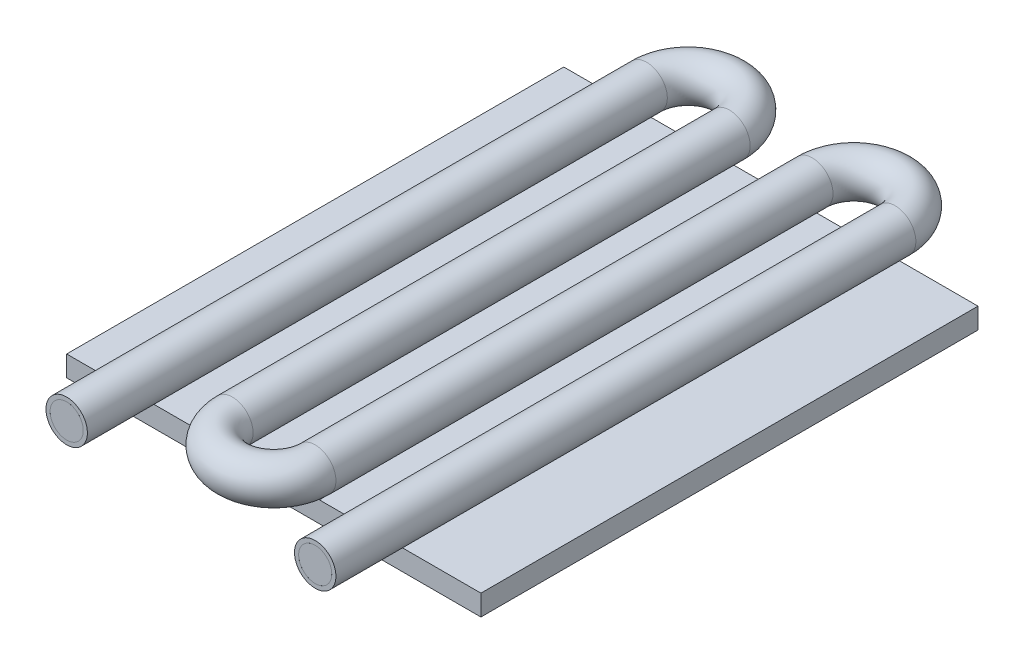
ISO-10303-21;
HEADER;
FILE_DESCRIPTION(('STEP AP214'),'2;1');
FILE_NAME('part.step','',(''),(''),'','','');
FILE_SCHEMA(('AUTOMOTIVE_DESIGN { 1 0 10303 214 1 1 1 1 }'));
ENDSEC;
DATA;
#1=APPLICATION_CONTEXT('core data for automotive mechanical design processes');
#2=APPLICATION_PROTOCOL_DEFINITION('international standard','automotive_design',2000,#1);
#3=PRODUCT_CONTEXT('',#1,'mechanical');
#4=PRODUCT('Part','Part','',(#3));
#5=PRODUCT_RELATED_PRODUCT_CATEGORY('part','',(#4));
#6=PRODUCT_DEFINITION_FORMATION('','',#4);
#7=PRODUCT_DEFINITION_CONTEXT('part definition',#1,'design');
#8=PRODUCT_DEFINITION('design','',#6,#7);
#9=PRODUCT_DEFINITION_SHAPE('','',#8);
#10=(LENGTH_UNIT() NAMED_UNIT(*) SI_UNIT(.MILLI.,.METRE.));
#11=(NAMED_UNIT(*) PLANE_ANGLE_UNIT() SI_UNIT($,.RADIAN.));
#12=(NAMED_UNIT(*) SI_UNIT($,.STERADIAN.) SOLID_ANGLE_UNIT());
#13=UNCERTAINTY_MEASURE_WITH_UNIT(LENGTH_MEASURE(1.E-05),#10,'distance_accuracy_value','');
#14=(GEOMETRIC_REPRESENTATION_CONTEXT(3) GLOBAL_UNCERTAINTY_ASSIGNED_CONTEXT((#13)) GLOBAL_UNIT_ASSIGNED_CONTEXT((#10,
#11,#12)) REPRESENTATION_CONTEXT('',''));
#15=CARTESIAN_POINT('',(0.,0.,0.));
#16=DIRECTION('',(0.,0.,1.));
#17=DIRECTION('',(1.,0.,0.));
#18=AXIS2_PLACEMENT_3D('',#15,#16,#17);
#19=CARTESIAN_POINT('',(60.,22.,155.));
#20=DIRECTION('',(0.,0.,1.));
#21=DIRECTION('',(1.,0.,0.));
#22=AXIS2_PLACEMENT_3D('',#19,#20,#21);
#23=CYLINDRICAL_SURFACE('',#22,8.);
#24=CARTESIAN_POINT('',(60.,22.,155.));
#25=DIRECTION('',(0.,0.,1.));
#26=DIRECTION('',(1.,0.,0.));
#27=AXIS2_PLACEMENT_3D('',#24,#25,#26);
#28=CIRCLE('',#27,8.);
#29=CARTESIAN_POINT('',(68.,22.,155.));
#30=VERTEX_POINT('',#29);
#31=EDGE_CURVE('E12',#30,#30,#28,.T.);
#32=ORIENTED_EDGE('',*,*,#31,.T.);
#33=EDGE_LOOP('',(#32));
#34=FACE_BOUND('',#33,.T.);
#35=CARTESIAN_POINT('',(60.,22.,160.));
#36=DIRECTION('',(0.,0.,1.));
#37=DIRECTION('',(1.,0.,0.));
#38=AXIS2_PLACEMENT_3D('',#35,#36,#37);
#39=CIRCLE('',#38,8.);
#40=CARTESIAN_POINT('',(68.,22.,160.));
#41=VERTEX_POINT('',#40);
#42=EDGE_CURVE('E65',#41,#41,#39,.T.);
#43=ORIENTED_EDGE('',*,*,#42,.F.);
#44=EDGE_LOOP('',(#43));
#45=FACE_BOUND('',#44,.T.);
#46=ADVANCED_FACE('F62',(#34,#45),#23,.T.);
#47=CARTESIAN_POINT('',(60.,22.,155.));
#48=DIRECTION('',(0.,0.,1.));
#49=DIRECTION('',(1.,0.,0.));
#50=AXIS2_PLACEMENT_3D('',#47,#48,#49);
#51=PLANE('',#50);
#52=ORIENTED_EDGE('',*,*,#31,.F.);
#53=EDGE_LOOP('',(#52));
#54=FACE_BOUND('',#53,.T.);
#55=ADVANCED_FACE('F77',(#54),#51,.F.);
#56=CARTESIAN_POINT('',(60.,22.,160.));
#57=DIRECTION('',(0.,0.,1.));
#58=DIRECTION('',(1.,0.,0.));
#59=AXIS2_PLACEMENT_3D('',#56,#57,#58);
#60=PLANE('',#59);
#61=ORIENTED_EDGE('',*,*,#42,.T.);
#62=EDGE_LOOP('',(#61));
#63=FACE_BOUND('',#62,.T.);
#64=ADVANCED_FACE('F74',(#63),#60,.T.);
#65=CLOSED_SHELL('',(#46,#55,#64));
#66=MANIFOLD_SOLID_BREP('B2',#65);
#67=CARTESIAN_POINT('',(-60.,22.,155.));
#68=DIRECTION('',(0.,0.,1.));
#69=DIRECTION('',(1.,0.,0.));
#70=AXIS2_PLACEMENT_3D('',#67,#68,#69);
#71=CYLINDRICAL_SURFACE('',#70,8.);
#72=CARTESIAN_POINT('',(-60.,22.,155.));
#73=DIRECTION('',(0.,0.,1.));
#74=DIRECTION('',(1.,0.,0.));
#75=AXIS2_PLACEMENT_3D('',#72,#73,#74);
#76=CIRCLE('',#75,8.);
#77=CARTESIAN_POINT('',(-52.,22.,155.));
#78=VERTEX_POINT('',#77);
#79=EDGE_CURVE('E61',#78,#78,#76,.T.);
#80=ORIENTED_EDGE('',*,*,#79,.T.);
#81=EDGE_LOOP('',(#80));
#82=FACE_BOUND('',#81,.T.);
#83=CARTESIAN_POINT('',(-60.,22.,160.));
#84=DIRECTION('',(0.,0.,1.));
#85=DIRECTION('',(1.,0.,0.));
#86=AXIS2_PLACEMENT_3D('',#83,#84,#85);
#87=CIRCLE('',#86,8.);
#88=CARTESIAN_POINT('',(-52.,22.,160.));
#89=VERTEX_POINT('',#88);
#90=EDGE_CURVE('E119',#89,#89,#87,.T.);
#91=ORIENTED_EDGE('',*,*,#90,.F.);
#92=EDGE_LOOP('',(#91));
#93=FACE_BOUND('',#92,.T.);
#94=ADVANCED_FACE('F116',(#82,#93),#71,.T.);
#95=CARTESIAN_POINT('',(-60.,22.,155.));
#96=DIRECTION('',(0.,0.,1.));
#97=DIRECTION('',(1.,0.,0.));
#98=AXIS2_PLACEMENT_3D('',#95,#96,#97);
#99=PLANE('',#98);
#100=ORIENTED_EDGE('',*,*,#79,.F.);
#101=EDGE_LOOP('',(#100));
#102=FACE_BOUND('',#101,.T.);
#103=ADVANCED_FACE('F131',(#102),#99,.F.);
#104=CARTESIAN_POINT('',(-60.,22.,160.));
#105=DIRECTION('',(0.,0.,1.));
#106=DIRECTION('',(1.,0.,0.));
#107=AXIS2_PLACEMENT_3D('',#104,#105,#106);
#108=PLANE('',#107);
#109=ORIENTED_EDGE('',*,*,#90,.T.);
#110=EDGE_LOOP('',(#109));
#111=FACE_BOUND('',#110,.T.);
#112=ADVANCED_FACE('F128',(#111),#108,.T.);
#113=CLOSED_SHELL('',(#94,#103,#112));
#114=MANIFOLD_SOLID_BREP('B7',#113);
#115=CARTESIAN_POINT('',(0.,10.,0.));
#116=DIRECTION('',(0.,-1.,0.));
#117=DIRECTION('',(0.,0.,-1.));
#118=AXIS2_PLACEMENT_3D('',#115,#116,#117);
#119=PLANE('',#118);
#120=DIRECTION('',(1.,0.,0.));
#121=VECTOR('',#120,1.);
#122=CARTESIAN_POINT('',(-100.,10.,120.));
#123=LINE('',#122,#121);
#124=CARTESIAN_POINT('',(-18.,10.,120.));
#125=VERTEX_POINT('',#124);
#126=CARTESIAN_POINT('',(18.,10.,120.));
#127=VERTEX_POINT('',#126);
#128=EDGE_CURVE('E184',#125,#127,#123,.T.);
#129=ORIENTED_EDGE('',*,*,#128,.T.);
#130=DIRECTION('',(0.,0.,1.));
#131=VECTOR('',#130,1.);
#132=CARTESIAN_POINT('',(18.,10.,-124.882622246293));
#133=LINE('',#132,#131);
#134=CARTESIAN_POINT('',(18.,10.,-120.));
#135=VERTEX_POINT('',#134);
#136=EDGE_CURVE('E313',#135,#127,#133,.T.);
#137=ORIENTED_EDGE('',*,*,#136,.F.);
#138=DIRECTION('',(-1.,0.,0.));
#139=VECTOR('',#138,1.);
#140=CARTESIAN_POINT('',(-100.,10.,-120.));
#141=LINE('',#140,#139);
#142=CARTESIAN_POINT('',(-18.,10.,-120.));
#143=VERTEX_POINT('',#142);
#144=EDGE_CURVE('E299',#135,#143,#141,.T.);
#145=ORIENTED_EDGE('',*,*,#144,.T.);
#146=DIRECTION('',(0.,0.,1.));
#147=VECTOR('',#146,1.);
#148=CARTESIAN_POINT('',(-18.,10.,-124.882622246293));
#149=LINE('',#148,#147);
#150=EDGE_CURVE('E337',#143,#125,#149,.T.);
#151=ORIENTED_EDGE('',*,*,#150,.T.);
#152=EDGE_LOOP('',(#129,#137,#145,#151));
#153=FACE_BOUND('',#152,.T.);
#154=ADVANCED_FACE('F161',(#153),#119,.F.);
#155=CARTESIAN_POINT('',(-58.,10.,120.));
#156=VERTEX_POINT('',#155);
#157=CARTESIAN_POINT('',(-22.,10.,120.));
#158=VERTEX_POINT('',#157);
#159=EDGE_CURVE('E459',#156,#158,#123,.T.);
#160=ORIENTED_EDGE('',*,*,#159,.T.);
#161=DIRECTION('',(0.,0.,1.));
#162=VECTOR('',#161,1.);
#163=CARTESIAN_POINT('',(-22.,10.,-124.882622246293));
#164=LINE('',#163,#162);
#165=CARTESIAN_POINT('',(-22.,10.,-120.));
#166=VERTEX_POINT('',#165);
#167=EDGE_CURVE('E345',#166,#158,#164,.T.);
#168=ORIENTED_EDGE('',*,*,#167,.F.);
#169=CARTESIAN_POINT('',(-58.,10.,-120.));
#170=VERTEX_POINT('',#169);
#171=EDGE_CURVE('E309',#166,#170,#141,.T.);
#172=ORIENTED_EDGE('',*,*,#171,.T.);
#173=DIRECTION('',(0.,0.,1.));
#174=VECTOR('',#173,1.);
#175=CARTESIAN_POINT('',(-58.,10.,-124.882622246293));
#176=LINE('',#175,#174);
#177=EDGE_CURVE('E436',#170,#156,#176,.T.);
#178=ORIENTED_EDGE('',*,*,#177,.T.);
#179=EDGE_LOOP('',(#160,#168,#172,#178));
#180=FACE_BOUND('',#179,.T.);
#181=ADVANCED_FACE('F569',(#180),#119,.F.);
#182=CARTESIAN_POINT('',(100.,10.,-120.));
#183=VERTEX_POINT('',#182);
#184=CARTESIAN_POINT('',(62.,10.,-120.));
#185=VERTEX_POINT('',#184);
#186=EDGE_CURVE('E311',#183,#185,#141,.T.);
#187=ORIENTED_EDGE('',*,*,#186,.T.);
#188=DIRECTION('',(0.,0.,-1.));
#189=VECTOR('',#188,1.);
#190=CARTESIAN_POINT('',(62.,10.,124.882622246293));
#191=LINE('',#190,#189);
#192=CARTESIAN_POINT('',(62.,10.,120.));
#193=VERTEX_POINT('',#192);
#194=EDGE_CURVE('E366',#193,#185,#191,.T.);
#195=ORIENTED_EDGE('',*,*,#194,.F.);
#196=CARTESIAN_POINT('',(100.,10.,120.));
#197=VERTEX_POINT('',#196);
#198=EDGE_CURVE('E454',#193,#197,#123,.T.);
#199=ORIENTED_EDGE('',*,*,#198,.T.);
#200=DIRECTION('',(0.,0.,-1.));
#201=VECTOR('',#200,1.);
#202=CARTESIAN_POINT('',(100.,10.,120.));
#203=LINE('',#202,#201);
#204=EDGE_CURVE('E447',#197,#183,#203,.T.);
#205=ORIENTED_EDGE('',*,*,#204,.T.);
#206=EDGE_LOOP('',(#187,#195,#199,#205));
#207=FACE_BOUND('',#206,.T.);
#208=ADVANCED_FACE('F518',(#207),#119,.F.);
#209=DIRECTION('',(0.,0.,1.));
#210=VECTOR('',#209,1.);
#211=CARTESIAN_POINT('',(-62.,10.,-124.882622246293));
#212=LINE('',#211,#210);
#213=CARTESIAN_POINT('',(-62.,10.,-120.));
#214=VERTEX_POINT('',#213);
#215=CARTESIAN_POINT('',(-62.,10.,120.));
#216=VERTEX_POINT('',#215);
#217=EDGE_CURVE('E443',#214,#216,#212,.T.);
#218=ORIENTED_EDGE('',*,*,#217,.F.);
#219=CARTESIAN_POINT('',(-100.,10.,-120.));
#220=VERTEX_POINT('',#219);
#221=EDGE_CURVE('E449',#214,#220,#141,.T.);
#222=ORIENTED_EDGE('',*,*,#221,.T.);
#223=DIRECTION('',(0.,0.,1.));
#224=VECTOR('',#223,1.);
#225=CARTESIAN_POINT('',(-100.,10.,120.));
#226=LINE('',#225,#224);
#227=CARTESIAN_POINT('',(-100.,10.,120.));
#228=VERTEX_POINT('',#227);
#229=EDGE_CURVE('E452',#220,#228,#226,.T.);
#230=ORIENTED_EDGE('',*,*,#229,.T.);
#231=EDGE_CURVE('E455',#228,#216,#123,.T.);
#232=ORIENTED_EDGE('',*,*,#231,.T.);
#233=EDGE_LOOP('',(#218,#222,#230,#232));
#234=FACE_BOUND('',#233,.T.);
#235=ADVANCED_FACE('F501',(#234),#119,.F.);
#236=CARTESIAN_POINT('',(100.,10.,120.));
#237=DIRECTION('',(-1.,0.,0.));
#238=DIRECTION('',(0.,0.,1.));
#239=AXIS2_PLACEMENT_3D('',#236,#237,#238);
#240=PLANE('',#239);
#241=DIRECTION('',(0.,0.,-1.));
#242=VECTOR('',#241,1.);
#243=CARTESIAN_POINT('',(100.,0.,120.));
#244=LINE('',#243,#242);
#245=CARTESIAN_POINT('',(100.,0.,120.));
#246=VERTEX_POINT('',#245);
#247=CARTESIAN_POINT('',(100.,0.,-120.));
#248=VERTEX_POINT('',#247);
#249=EDGE_CURVE('E438',#246,#248,#244,.T.);
#250=ORIENTED_EDGE('',*,*,#249,.T.);
#251=DIRECTION('',(0.,-1.,0.));
#252=VECTOR('',#251,1.);
#253=CARTESIAN_POINT('',(100.,10.,-120.));
#254=LINE('',#253,#252);
#255=EDGE_CURVE('E476',#183,#248,#254,.T.);
#256=ORIENTED_EDGE('',*,*,#255,.F.);
#257=ORIENTED_EDGE('',*,*,#204,.F.);
#258=DIRECTION('',(0.,-1.,0.));
#259=VECTOR('',#258,1.);
#260=CARTESIAN_POINT('',(100.,10.,120.));
#261=LINE('',#260,#259);
#262=EDGE_CURVE('E458',#197,#246,#261,.T.);
#263=ORIENTED_EDGE('',*,*,#262,.T.);
#264=EDGE_LOOP('',(#250,#256,#257,#263));
#265=FACE_BOUND('',#264,.T.);
#266=ADVANCED_FACE('F163',(#265),#240,.F.);
#267=CARTESIAN_POINT('',(-100.,10.,-120.));
#268=DIRECTION('',(0.,0.,1.));
#269=DIRECTION('',(1.,0.,0.));
#270=AXIS2_PLACEMENT_3D('',#267,#268,#269);
#271=PLANE('',#270);
#272=DIRECTION('',(0.,1.,0.));
#273=VECTOR('',#272,1.);
#274=CARTESIAN_POINT('',(-62.,12.8,-120.));
#275=LINE('',#274,#273);
#276=CARTESIAN_POINT('',(-62.,12.2020410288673,-120.));
#277=VERTEX_POINT('',#276);
#278=EDGE_CURVE('E435',#214,#277,#275,.T.);
#279=ORIENTED_EDGE('',*,*,#278,.T.);
#280=CARTESIAN_POINT('',(-60.,22.,-120.));
#281=DIRECTION('',(0.,0.,1.));
#282=DIRECTION('',(1.,0.,0.));
#283=AXIS2_PLACEMENT_3D('',#280,#281,#282);
#284=CIRCLE('',#283,10.);
#285=CARTESIAN_POINT('',(-58.,12.2020410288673,-120.));
#286=VERTEX_POINT('',#285);
#287=EDGE_CURVE('E418',#277,#286,#284,.T.);
#288=ORIENTED_EDGE('',*,*,#287,.T.);
#289=DIRECTION('',(0.,-1.,0.));
#290=VECTOR('',#289,1.);
#291=CARTESIAN_POINT('',(-58.,12.8,-120.));
#292=LINE('',#291,#290);
#293=EDGE_CURVE('E432',#286,#170,#292,.T.);
#294=ORIENTED_EDGE('',*,*,#293,.T.);
#295=ORIENTED_EDGE('',*,*,#171,.F.);
#296=DIRECTION('',(0.,1.,0.));
#297=VECTOR('',#296,1.);
#298=CARTESIAN_POINT('',(-22.,10.,-120.));
#299=LINE('',#298,#297);
#300=CARTESIAN_POINT('',(-22.,12.2020410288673,-120.));
#301=VERTEX_POINT('',#300);
#302=EDGE_CURVE('E336',#166,#301,#299,.T.);
#303=ORIENTED_EDGE('',*,*,#302,.T.);
#304=CARTESIAN_POINT('',(-20.,22.,-120.));
#305=DIRECTION('',(0.,0.,1.));
#306=DIRECTION('',(1.,0.,0.));
#307=AXIS2_PLACEMENT_3D('',#304,#305,#306);
#308=CIRCLE('',#307,10.);
#309=CARTESIAN_POINT('',(-18.,12.2020410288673,-120.));
#310=VERTEX_POINT('',#309);
#311=EDGE_CURVE('E414',#310,#301,#308,.F.);
#312=ORIENTED_EDGE('',*,*,#311,.F.);
#313=DIRECTION('',(0.,-1.,0.));
#314=VECTOR('',#313,1.);
#315=CARTESIAN_POINT('',(-18.,10.,-120.));
#316=LINE('',#315,#314);
#317=EDGE_CURVE('E306',#310,#143,#316,.T.);
#318=ORIENTED_EDGE('',*,*,#317,.T.);
#319=ORIENTED_EDGE('',*,*,#144,.F.);
#320=DIRECTION('',(0.,1.,0.));
#321=VECTOR('',#320,1.);
#322=CARTESIAN_POINT('',(18.,12.8,-120.));
#323=LINE('',#322,#321);
#324=CARTESIAN_POINT('',(18.,12.2020410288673,-120.));
#325=VERTEX_POINT('',#324);
#326=EDGE_CURVE('E303',#135,#325,#323,.T.);
#327=ORIENTED_EDGE('',*,*,#326,.T.);
#328=CARTESIAN_POINT('',(20.,22.,-120.));
#329=DIRECTION('',(0.,0.,1.));
#330=DIRECTION('',(1.,0.,0.));
#331=AXIS2_PLACEMENT_3D('',#328,#329,#330);
#332=CIRCLE('',#331,10.);
#333=CARTESIAN_POINT('',(22.,12.2020410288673,-120.));
#334=VERTEX_POINT('',#333);
#335=EDGE_CURVE('E404',#325,#334,#332,.T.);
#336=ORIENTED_EDGE('',*,*,#335,.T.);
#337=DIRECTION('',(0.,-1.,0.));
#338=VECTOR('',#337,1.);
#339=CARTESIAN_POINT('',(22.,12.8,-120.));
#340=LINE('',#339,#338);
#341=CARTESIAN_POINT('',(22.,10.,-120.));
#342=VERTEX_POINT('',#341);
#343=EDGE_CURVE('E322',#334,#342,#340,.T.);
#344=ORIENTED_EDGE('',*,*,#343,.T.);
#345=CARTESIAN_POINT('',(58.,10.,-120.));
#346=VERTEX_POINT('',#345);
#347=EDGE_CURVE('E308',#346,#342,#141,.T.);
#348=ORIENTED_EDGE('',*,*,#347,.F.);
#349=DIRECTION('',(0.,1.,0.));
#350=VECTOR('',#349,1.);
#351=CARTESIAN_POINT('',(58.,10.,-120.));
#352=LINE('',#351,#350);
#353=CARTESIAN_POINT('',(58.,12.2020410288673,-120.));
#354=VERTEX_POINT('',#353);
#355=EDGE_CURVE('E364',#346,#354,#352,.T.);
#356=ORIENTED_EDGE('',*,*,#355,.T.);
#357=CARTESIAN_POINT('',(60.,22.,-120.));
#358=DIRECTION('',(0.,0.,1.));
#359=DIRECTION('',(1.,0.,0.));
#360=AXIS2_PLACEMENT_3D('',#357,#358,#359);
#361=CIRCLE('',#360,10.);
#362=CARTESIAN_POINT('',(62.,12.2020410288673,-120.));
#363=VERTEX_POINT('',#362);
#364=EDGE_CURVE('E399',#363,#354,#361,.F.);
#365=ORIENTED_EDGE('',*,*,#364,.F.);
#366=DIRECTION('',(0.,-1.,0.));
#367=VECTOR('',#366,1.);
#368=CARTESIAN_POINT('',(62.,10.,-120.));
#369=LINE('',#368,#367);
#370=EDGE_CURVE('E353',#363,#185,#369,.T.);
#371=ORIENTED_EDGE('',*,*,#370,.T.);
#372=ORIENTED_EDGE('',*,*,#186,.F.);
#373=ORIENTED_EDGE('',*,*,#255,.T.);
#374=DIRECTION('',(-1.,0.,0.));
#375=VECTOR('',#374,1.);
#376=CARTESIAN_POINT('',(-100.,0.,-120.));
#377=LINE('',#376,#375);
#378=CARTESIAN_POINT('',(-100.,0.,-120.));
#379=VERTEX_POINT('',#378);
#380=EDGE_CURVE('E463',#248,#379,#377,.T.);
#381=ORIENTED_EDGE('',*,*,#380,.T.);
#382=DIRECTION('',(0.,-1.,0.));
#383=VECTOR('',#382,1.);
#384=CARTESIAN_POINT('',(-100.,10.,-120.));
#385=LINE('',#384,#383);
#386=EDGE_CURVE('E473',#220,#379,#385,.T.);
#387=ORIENTED_EDGE('',*,*,#386,.F.);
#388=ORIENTED_EDGE('',*,*,#221,.F.);
#389=EDGE_LOOP('',(#279,#288,#294,#295,#303,#312,#318,#319,#327,#336,#344,#348,#356,#365,#371,
#372,#373,#381,#387,#388));
#390=FACE_BOUND('',#389,.T.);
#391=ADVANCED_FACE('F301',(#390),#271,.F.);
#392=CARTESIAN_POINT('',(-100.,10.,120.));
#393=DIRECTION('',(1.,0.,0.));
#394=DIRECTION('',(0.,0.,-1.));
#395=AXIS2_PLACEMENT_3D('',#392,#393,#394);
#396=PLANE('',#395);
#397=DIRECTION('',(0.,0.,1.));
#398=VECTOR('',#397,1.);
#399=CARTESIAN_POINT('',(-100.,0.,120.));
#400=LINE('',#399,#398);
#401=CARTESIAN_POINT('',(-100.,0.,120.));
#402=VERTEX_POINT('',#401);
#403=EDGE_CURVE('E465',#379,#402,#400,.T.);
#404=ORIENTED_EDGE('',*,*,#403,.T.);
#405=DIRECTION('',(0.,-1.,0.));
#406=VECTOR('',#405,1.);
#407=CARTESIAN_POINT('',(-100.,10.,120.));
#408=LINE('',#407,#406);
#409=EDGE_CURVE('E470',#228,#402,#408,.T.);
#410=ORIENTED_EDGE('',*,*,#409,.F.);
#411=ORIENTED_EDGE('',*,*,#229,.F.);
#412=ORIENTED_EDGE('',*,*,#386,.T.);
#413=EDGE_LOOP('',(#404,#410,#411,#412));
#414=FACE_BOUND('',#413,.T.);
#415=ADVANCED_FACE('F505',(#414),#396,.F.);
#416=CARTESIAN_POINT('',(-100.,10.,120.));
#417=DIRECTION('',(0.,0.,-1.));
#418=DIRECTION('',(-1.,0.,0.));
#419=AXIS2_PLACEMENT_3D('',#416,#417,#418);
#420=PLANE('',#419);
#421=DIRECTION('',(0.,1.,0.));
#422=VECTOR('',#421,1.);
#423=CARTESIAN_POINT('',(-58.,12.8,120.));
#424=LINE('',#423,#422);
#425=CARTESIAN_POINT('',(-58.,12.2020410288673,120.));
#426=VERTEX_POINT('',#425);
#427=EDGE_CURVE('E440',#156,#426,#424,.T.);
#428=ORIENTED_EDGE('',*,*,#427,.T.);
#429=CARTESIAN_POINT('',(-60.,22.,120.));
#430=DIRECTION('',(0.,0.,-1.));
#431=DIRECTION('',(-1.,0.,0.));
#432=AXIS2_PLACEMENT_3D('',#429,#430,#431);
#433=CIRCLE('',#432,10.);
#434=CARTESIAN_POINT('',(-62.,12.2020410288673,120.));
#435=VERTEX_POINT('',#434);
#436=EDGE_CURVE('E426',#426,#435,#433,.T.);
#437=ORIENTED_EDGE('',*,*,#436,.T.);
#438=DIRECTION('',(0.,-1.,0.));
#439=VECTOR('',#438,1.);
#440=CARTESIAN_POINT('',(-62.,12.8,120.));
#441=LINE('',#440,#439);
#442=EDGE_CURVE('E431',#435,#216,#441,.T.);
#443=ORIENTED_EDGE('',*,*,#442,.T.);
#444=ORIENTED_EDGE('',*,*,#231,.F.);
#445=ORIENTED_EDGE('',*,*,#409,.T.);
#446=DIRECTION('',(1.,0.,0.));
#447=VECTOR('',#446,1.);
#448=CARTESIAN_POINT('',(-100.,0.,120.));
#449=LINE('',#448,#447);
#450=EDGE_CURVE('E450',#402,#246,#449,.T.);
#451=ORIENTED_EDGE('',*,*,#450,.T.);
#452=ORIENTED_EDGE('',*,*,#262,.F.);
#453=ORIENTED_EDGE('',*,*,#198,.F.);
#454=DIRECTION('',(0.,1.,0.));
#455=VECTOR('',#454,1.);
#456=CARTESIAN_POINT('',(62.,10.,120.));
#457=LINE('',#456,#455);
#458=CARTESIAN_POINT('',(62.,12.2020410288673,120.));
#459=VERTEX_POINT('',#458);
#460=EDGE_CURVE('E357',#193,#459,#457,.T.);
#461=ORIENTED_EDGE('',*,*,#460,.T.);
#462=CARTESIAN_POINT('',(60.,22.,120.));
#463=DIRECTION('',(0.,0.,-1.));
#464=DIRECTION('',(-1.,0.,0.));
#465=AXIS2_PLACEMENT_3D('',#462,#463,#464);
#466=CIRCLE('',#465,10.);
#467=CARTESIAN_POINT('',(58.,12.2020410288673,120.));
#468=VERTEX_POINT('',#467);
#469=EDGE_CURVE('E114',#468,#459,#466,.F.);
#470=ORIENTED_EDGE('',*,*,#469,.F.);
#471=DIRECTION('',(0.,-1.,0.));
#472=VECTOR('',#471,1.);
#473=CARTESIAN_POINT('',(58.,10.,120.));
#474=LINE('',#473,#472);
#475=CARTESIAN_POINT('',(58.,10.,120.));
#476=VERTEX_POINT('',#475);
#477=EDGE_CURVE('E354',#468,#476,#474,.T.);
#478=ORIENTED_EDGE('',*,*,#477,.T.);
#479=CARTESIAN_POINT('',(22.,10.,120.));
#480=VERTEX_POINT('',#479);
#481=EDGE_CURVE('E460',#480,#476,#123,.T.);
#482=ORIENTED_EDGE('',*,*,#481,.F.);
#483=DIRECTION('',(0.,1.,0.));
#484=VECTOR('',#483,1.);
#485=CARTESIAN_POINT('',(22.,12.8,120.));
#486=LINE('',#485,#484);
#487=CARTESIAN_POINT('',(22.,12.2020410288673,120.));
#488=VERTEX_POINT('',#487);
#489=EDGE_CURVE('E316',#480,#488,#486,.T.);
#490=ORIENTED_EDGE('',*,*,#489,.T.);
#491=CARTESIAN_POINT('',(20.,22.,120.));
#492=DIRECTION('',(0.,0.,-1.));
#493=DIRECTION('',(-1.,0.,0.));
#494=AXIS2_PLACEMENT_3D('',#491,#492,#493);
#495=CIRCLE('',#494,10.);
#496=CARTESIAN_POINT('',(18.,12.2020410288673,120.));
#497=VERTEX_POINT('',#496);
#498=EDGE_CURVE('E407',#497,#488,#495,.F.);
#499=ORIENTED_EDGE('',*,*,#498,.F.);
#500=DIRECTION('',(0.,-1.,0.));
#501=VECTOR('',#500,1.);
#502=CARTESIAN_POINT('',(18.,12.8,120.));
#503=LINE('',#502,#501);
#504=EDGE_CURVE('E329',#497,#127,#503,.T.);
#505=ORIENTED_EDGE('',*,*,#504,.T.);
#506=ORIENTED_EDGE('',*,*,#128,.F.);
#507=DIRECTION('',(0.,1.,0.));
#508=VECTOR('',#507,1.);
#509=CARTESIAN_POINT('',(-18.,10.,120.));
#510=LINE('',#509,#508);
#511=CARTESIAN_POINT('',(-18.,12.2020410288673,120.));
#512=VERTEX_POINT('',#511);
#513=EDGE_CURVE('E342',#125,#512,#510,.T.);
#514=ORIENTED_EDGE('',*,*,#513,.T.);
#515=CARTESIAN_POINT('',(-20.,22.,120.));
#516=DIRECTION('',(0.,0.,-1.));
#517=DIRECTION('',(-1.,0.,0.));
#518=AXIS2_PLACEMENT_3D('',#515,#516,#517);
#519=CIRCLE('',#518,10.);
#520=CARTESIAN_POINT('',(-22.,12.2020410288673,120.));
#521=VERTEX_POINT('',#520);
#522=EDGE_CURVE('E411',#512,#521,#519,.T.);
#523=ORIENTED_EDGE('',*,*,#522,.T.);
#524=DIRECTION('',(0.,-1.,0.));
#525=VECTOR('',#524,1.);
#526=CARTESIAN_POINT('',(-22.,10.,120.));
#527=LINE('',#526,#525);
#528=EDGE_CURVE('E334',#521,#158,#527,.T.);
#529=ORIENTED_EDGE('',*,*,#528,.T.);
#530=ORIENTED_EDGE('',*,*,#159,.F.);
#531=EDGE_LOOP('',(#428,#437,#443,#444,#445,#451,#452,#453,#461,#470,#478,#482,#490,#499,#505,
#506,#514,#523,#529,#530));
#532=FACE_BOUND('',#531,.T.);
#533=ADVANCED_FACE('F499',(#532),#420,.F.);
#534=ORIENTED_EDGE('',*,*,#347,.T.);
#535=DIRECTION('',(0.,0.,1.));
#536=VECTOR('',#535,1.);
#537=CARTESIAN_POINT('',(22.,10.,-124.882622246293));
#538=LINE('',#537,#536);
#539=EDGE_CURVE('E176',#342,#480,#538,.T.);
#540=ORIENTED_EDGE('',*,*,#539,.T.);
#541=ORIENTED_EDGE('',*,*,#481,.T.);
#542=DIRECTION('',(0.,0.,-1.));
#543=VECTOR('',#542,1.);
#544=CARTESIAN_POINT('',(58.,10.,124.882622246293));
#545=LINE('',#544,#543);
#546=EDGE_CURVE('E358',#476,#346,#545,.T.);
#547=ORIENTED_EDGE('',*,*,#546,.T.);
#548=EDGE_LOOP('',(#534,#540,#541,#547));
#549=FACE_BOUND('',#548,.T.);
#550=ADVANCED_FACE('F589',(#549),#119,.F.);
#551=CARTESIAN_POINT('',(0.,0.,0.));
#552=DIRECTION('',(0.,-1.,0.));
#553=DIRECTION('',(0.,0.,-1.));
#554=AXIS2_PLACEMENT_3D('',#551,#552,#553);
#555=PLANE('',#554);
#556=ORIENTED_EDGE('',*,*,#249,.F.);
#557=ORIENTED_EDGE('',*,*,#450,.F.);
#558=ORIENTED_EDGE('',*,*,#403,.F.);
#559=ORIENTED_EDGE('',*,*,#380,.F.);
#560=EDGE_LOOP('',(#556,#557,#558,#559));
#561=FACE_BOUND('',#560,.T.);
#562=ADVANCED_FACE('F511',(#561),#555,.T.);
#563=CARTESIAN_POINT('',(-62.,12.8,-124.882622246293));
#564=DIRECTION('',(-1.,0.,0.));
#565=DIRECTION('',(0.,0.,1.));
#566=AXIS2_PLACEMENT_3D('',#563,#564,#565);
#567=PLANE('',#566);
#568=DIRECTION('',(0.,0.,1.));
#569=VECTOR('',#568,1.);
#570=CARTESIAN_POINT('',(-62.,12.2020410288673,-120.));
#571=LINE('',#570,#569);
#572=EDGE_CURVE('E428',#277,#435,#571,.T.);
#573=ORIENTED_EDGE('',*,*,#572,.F.);
#574=ORIENTED_EDGE('',*,*,#278,.F.);
#575=ORIENTED_EDGE('',*,*,#217,.T.);
#576=ORIENTED_EDGE('',*,*,#442,.F.);
#577=EDGE_LOOP('',(#573,#574,#575,#576));
#578=FACE_BOUND('',#577,.T.);
#579=ADVANCED_FACE('F495',(#578),#567,.T.);
#580=CARTESIAN_POINT('',(-58.,12.8,-124.882622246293));
#581=DIRECTION('',(1.,0.,0.));
#582=DIRECTION('',(0.,0.,-1.));
#583=AXIS2_PLACEMENT_3D('',#580,#581,#582);
#584=PLANE('',#583);
#585=DIRECTION('',(0.,0.,1.));
#586=VECTOR('',#585,1.);
#587=CARTESIAN_POINT('',(-58.,12.2020410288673,-120.));
#588=LINE('',#587,#586);
#589=EDGE_CURVE('E169',#426,#286,#588,.F.);
#590=ORIENTED_EDGE('',*,*,#589,.F.);
#591=ORIENTED_EDGE('',*,*,#427,.F.);
#592=ORIENTED_EDGE('',*,*,#177,.F.);
#593=ORIENTED_EDGE('',*,*,#293,.F.);
#594=EDGE_LOOP('',(#590,#591,#592,#593));
#595=FACE_BOUND('',#594,.T.);
#596=ADVANCED_FACE('F570',(#595),#584,.T.);
#597=CARTESIAN_POINT('',(60.,22.,160.));
#598=DIRECTION('',(0.,0.,-1.));
#599=DIRECTION('',(0.,1.,0.));
#600=AXIS2_PLACEMENT_3D('',#597,#598,#599);
#601=PLANE('',#600);
#602=CARTESIAN_POINT('',(60.,22.,160.));
#603=DIRECTION('',(0.,0.,-1.));
#604=DIRECTION('',(0.,1.,0.));
#605=AXIS2_PLACEMENT_3D('',#602,#603,#604);
#606=CIRCLE('',#605,8.);
#607=CARTESIAN_POINT('',(60.,30.,160.));
#608=VERTEX_POINT('',#607);
#609=EDGE_CURVE('E374',#608,#608,#606,.T.);
#610=ORIENTED_EDGE('',*,*,#609,.T.);
#611=EDGE_LOOP('',(#610));
#612=FACE_BOUND('',#611,.T.);
#613=CARTESIAN_POINT('',(60.,22.,160.));
#614=DIRECTION('',(0.,0.,-1.));
#615=DIRECTION('',(0.,1.,0.));
#616=AXIS2_PLACEMENT_3D('',#613,#614,#615);
#617=CIRCLE('',#616,10.);
#618=CARTESIAN_POINT('',(60.,32.,160.));
#619=VERTEX_POINT('',#618);
#620=EDGE_CURVE('E398',#619,#619,#617,.T.);
#621=ORIENTED_EDGE('',*,*,#620,.F.);
#622=EDGE_LOOP('',(#621));
#623=FACE_BOUND('',#622,.T.);
#624=ADVANCED_FACE('F572',(#612,#623),#601,.F.);
#625=CARTESIAN_POINT('',(-60.,22.,160.));
#626=DIRECTION('',(0.,0.,1.));
#627=DIRECTION('',(0.,1.,0.));
#628=AXIS2_PLACEMENT_3D('',#625,#626,#627);
#629=PLANE('',#628);
#630=CARTESIAN_POINT('',(-60.,22.,160.));
#631=DIRECTION('',(0.,0.,1.));
#632=DIRECTION('',(0.,1.,0.));
#633=AXIS2_PLACEMENT_3D('',#630,#631,#632);
#634=CIRCLE('',#633,8.);
#635=CARTESIAN_POINT('',(-60.,30.,160.));
#636=VERTEX_POINT('',#635);
#637=EDGE_CURVE('E395',#636,#636,#634,.T.);
#638=ORIENTED_EDGE('',*,*,#637,.F.);
#639=EDGE_LOOP('',(#638));
#640=FACE_BOUND('',#639,.T.);
#641=CARTESIAN_POINT('',(-60.,22.,160.));
#642=DIRECTION('',(0.,0.,1.));
#643=DIRECTION('',(1.,0.,0.));
#644=AXIS2_PLACEMENT_3D('',#641,#642,#643);
#645=CIRCLE('',#644,10.);
#646=CARTESIAN_POINT('',(-50.,22.,160.));
#647=VERTEX_POINT('',#646);
#648=EDGE_CURVE('E421',#647,#647,#645,.T.);
#649=ORIENTED_EDGE('',*,*,#648,.T.);
#650=EDGE_LOOP('',(#649));
#651=FACE_BOUND('',#650,.T.);
#652=ADVANCED_FACE('F578',(#640,#651),#629,.T.);
#653=CARTESIAN_POINT('',(60.,22.,160.));
#654=DIRECTION('',(0.,0.,-1.));
#655=DIRECTION('',(-1.,0.,0.));
#656=AXIS2_PLACEMENT_3D('',#653,#654,#655);
#657=CYLINDRICAL_SURFACE('',#656,10.);
#658=DIRECTION('',(0.,0.,-1.));
#659=VECTOR('',#658,1.);
#660=CARTESIAN_POINT('',(62.,12.2020410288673,160.));
#661=LINE('',#660,#659);
#662=EDGE_CURVE('E372',#363,#459,#661,.F.);
#663=ORIENTED_EDGE('',*,*,#662,.F.);
#664=EDGE_CURVE('E403',#354,#363,#361,.F.);
#665=ORIENTED_EDGE('',*,*,#664,.F.);
#666=DIRECTION('',(0.,0.,-1.));
#667=VECTOR('',#666,1.);
#668=CARTESIAN_POINT('',(58.,12.2020410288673,160.));
#669=LINE('',#668,#667);
#670=EDGE_CURVE('E361',#468,#354,#669,.T.);
#671=ORIENTED_EDGE('',*,*,#670,.F.);
#672=ORIENTED_EDGE('',*,*,#469,.T.);
#673=EDGE_LOOP('',(#663,#665,#671,#672));
#674=FACE_BOUND('',#673,.T.);
#675=ORIENTED_EDGE('',*,*,#620,.T.);
#676=EDGE_LOOP('',(#675));
#677=FACE_BOUND('',#676,.T.);
#678=ADVANCED_FACE('F526',(#674,#677),#657,.T.);
#679=CARTESIAN_POINT('',(40.,22.,-120.));
#680=DIRECTION('',(0.,1.,0.));
#681=DIRECTION('',(0.,0.,1.));
#682=AXIS2_PLACEMENT_3D('',#679,#680,#681);
#683=TOROIDAL_SURFACE('',#682,20.,10.);
#684=ORIENTED_EDGE('',*,*,#335,.F.);
#685=EDGE_CURVE('E402',#334,#325,#332,.T.);
#686=ORIENTED_EDGE('',*,*,#685,.F.);
#687=EDGE_LOOP('',(#684,#686));
#688=FACE_BOUND('',#687,.T.);
#689=ORIENTED_EDGE('',*,*,#364,.T.);
#690=ORIENTED_EDGE('',*,*,#664,.T.);
#691=EDGE_LOOP('',(#689,#690));
#692=FACE_BOUND('',#691,.T.);
#693=ADVANCED_FACE('F530',(#688,#692),#683,.T.);
#694=CARTESIAN_POINT('',(20.,22.,-120.));
#695=DIRECTION('',(0.,0.,1.));
#696=DIRECTION('',(1.,0.,0.));
#697=AXIS2_PLACEMENT_3D('',#694,#695,#696);
#698=CYLINDRICAL_SURFACE('',#697,10.);
#699=DIRECTION('',(0.,0.,1.));
#700=VECTOR('',#699,1.);
#701=CARTESIAN_POINT('',(18.,12.2020410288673,-120.));
#702=LINE('',#701,#700);
#703=EDGE_CURVE('E320',#497,#325,#702,.F.);
#704=ORIENTED_EDGE('',*,*,#703,.F.);
#705=EDGE_CURVE('E406',#488,#497,#495,.F.);
#706=ORIENTED_EDGE('',*,*,#705,.F.);
#707=DIRECTION('',(0.,0.,1.));
#708=VECTOR('',#707,1.);
#709=CARTESIAN_POINT('',(22.,12.2020410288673,-120.));
#710=LINE('',#709,#708);
#711=EDGE_CURVE('E321',#334,#488,#710,.T.);
#712=ORIENTED_EDGE('',*,*,#711,.F.);
#713=ORIENTED_EDGE('',*,*,#685,.T.);
#714=EDGE_LOOP('',(#704,#706,#712,#713));
#715=FACE_BOUND('',#714,.T.);
#716=ADVANCED_FACE('F546',(#715),#698,.T.);
#717=CARTESIAN_POINT('',(0.,22.,120.));
#718=DIRECTION('',(0.,-1.,0.));
#719=DIRECTION('',(0.,0.,-1.));
#720=AXIS2_PLACEMENT_3D('',#717,#718,#719);
#721=TOROIDAL_SURFACE('',#720,20.,10.);
#722=ORIENTED_EDGE('',*,*,#522,.F.);
#723=EDGE_CURVE('E410',#521,#512,#519,.T.);
#724=ORIENTED_EDGE('',*,*,#723,.F.);
#725=EDGE_LOOP('',(#722,#724));
#726=FACE_BOUND('',#725,.T.);
#727=ORIENTED_EDGE('',*,*,#498,.T.);
#728=ORIENTED_EDGE('',*,*,#705,.T.);
#729=EDGE_LOOP('',(#727,#728));
#730=FACE_BOUND('',#729,.T.);
#731=ADVANCED_FACE('F548',(#726,#730),#721,.T.);
#732=CARTESIAN_POINT('',(-20.,22.,120.));
#733=DIRECTION('',(0.,0.,-1.));
#734=DIRECTION('',(-1.,0.,0.));
#735=AXIS2_PLACEMENT_3D('',#732,#733,#734);
#736=CYLINDRICAL_SURFACE('',#735,10.);
#737=DIRECTION('',(0.,0.,-1.));
#738=VECTOR('',#737,1.);
#739=CARTESIAN_POINT('',(-22.,12.2020410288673,120.));
#740=LINE('',#739,#738);
#741=EDGE_CURVE('E350',#521,#301,#740,.T.);
#742=ORIENTED_EDGE('',*,*,#741,.F.);
#743=ORIENTED_EDGE('',*,*,#723,.T.);
#744=DIRECTION('',(0.,0.,-1.));
#745=VECTOR('',#744,1.);
#746=CARTESIAN_POINT('',(-18.,12.2020410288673,120.));
#747=LINE('',#746,#745);
#748=EDGE_CURVE('E339',#310,#512,#747,.F.);
#749=ORIENTED_EDGE('',*,*,#748,.F.);
#750=EDGE_CURVE('E413',#301,#310,#308,.F.);
#751=ORIENTED_EDGE('',*,*,#750,.F.);
#752=EDGE_LOOP('',(#742,#743,#749,#751));
#753=FACE_BOUND('',#752,.T.);
#754=ADVANCED_FACE('F558',(#753),#736,.T.);
#755=CARTESIAN_POINT('',(-40.,22.,-120.));
#756=DIRECTION('',(0.,1.,0.));
#757=DIRECTION('',(0.,0.,1.));
#758=AXIS2_PLACEMENT_3D('',#755,#756,#757);
#759=TOROIDAL_SURFACE('',#758,20.,10.);
#760=ORIENTED_EDGE('',*,*,#287,.F.);
#761=EDGE_CURVE('E417',#286,#277,#284,.T.);
#762=ORIENTED_EDGE('',*,*,#761,.F.);
#763=EDGE_LOOP('',(#760,#762));
#764=FACE_BOUND('',#763,.T.);
#765=ORIENTED_EDGE('',*,*,#311,.T.);
#766=ORIENTED_EDGE('',*,*,#750,.T.);
#767=EDGE_LOOP('',(#765,#766));
#768=FACE_BOUND('',#767,.T.);
#769=ADVANCED_FACE('F488',(#764,#768),#759,.T.);
#770=CARTESIAN_POINT('',(-60.,22.,-120.));
#771=DIRECTION('',(0.,0.,1.));
#772=DIRECTION('',(1.,0.,0.));
#773=AXIS2_PLACEMENT_3D('',#770,#771,#772);
#774=CYLINDRICAL_SURFACE('',#773,10.);
#775=ORIENTED_EDGE('',*,*,#648,.F.);
#776=EDGE_LOOP('',(#775));
#777=FACE_BOUND('',#776,.T.);
#778=ORIENTED_EDGE('',*,*,#761,.T.);
#779=ORIENTED_EDGE('',*,*,#572,.T.);
#780=ORIENTED_EDGE('',*,*,#436,.F.);
#781=ORIENTED_EDGE('',*,*,#589,.T.);
#782=EDGE_LOOP('',(#778,#779,#780,#781));
#783=FACE_BOUND('',#782,.T.);
#784=ADVANCED_FACE('F483',(#777,#783),#774,.T.);
#785=CARTESIAN_POINT('',(60.,22.,160.));
#786=DIRECTION('',(0.,0.,-1.));
#787=DIRECTION('',(-1.,0.,0.));
#788=AXIS2_PLACEMENT_3D('',#785,#786,#787);
#789=CYLINDRICAL_SURFACE('',#788,8.);
#790=CARTESIAN_POINT('',(60.,22.,-120.));
#791=DIRECTION('',(0.,0.,-1.));
#792=DIRECTION('',(0.,1.,0.));
#793=AXIS2_PLACEMENT_3D('',#790,#791,#792);
#794=CIRCLE('',#793,8.);
#795=CARTESIAN_POINT('',(68.,22.,-120.));
#796=VERTEX_POINT('',#795);
#797=EDGE_CURVE('E377',#796,#796,#794,.T.);
#798=ORIENTED_EDGE('',*,*,#797,.T.);
#799=EDGE_LOOP('',(#798));
#800=FACE_BOUND('',#799,.T.);
#801=ORIENTED_EDGE('',*,*,#609,.F.);
#802=EDGE_LOOP('',(#801));
#803=FACE_BOUND('',#802,.T.);
#804=ADVANCED_FACE('F585',(#800,#803),#789,.F.);
#805=CARTESIAN_POINT('',(40.,22.,-120.));
#806=DIRECTION('',(0.,1.,0.));
#807=DIRECTION('',(0.,0.,1.));
#808=AXIS2_PLACEMENT_3D('',#805,#806,#807);
#809=TOROIDAL_SURFACE('',#808,20.,8.);
#810=CARTESIAN_POINT('',(20.,22.,-120.));
#811=DIRECTION('',(0.,0.,1.));
#812=DIRECTION('',(0.,1.,0.));
#813=AXIS2_PLACEMENT_3D('',#810,#811,#812);
#814=CIRCLE('',#813,8.);
#815=CARTESIAN_POINT('',(12.,22.,-120.));
#816=VERTEX_POINT('',#815);
#817=EDGE_CURVE('E380',#816,#816,#814,.T.);
#818=CARTESIAN_POINT('',(40.,22.,-120.));
#819=DIRECTION('',(0.,1.,0.));
#820=DIRECTION('',(0.,0.,1.));
#821=AXIS2_PLACEMENT_3D('',#818,#819,#820);
#822=CIRCLE('',#821,28.);
#823=EDGE_CURVE('',#796,#816,#822,.T.);
#824=ORIENTED_EDGE('',*,*,#797,.F.);
#825=ORIENTED_EDGE('',*,*,#817,.T.);
#826=ORIENTED_EDGE('',*,*,#823,.T.);
#827=ORIENTED_EDGE('',*,*,#823,.F.);
#828=EDGE_LOOP('',(#824,#826,#825,#827));
#829=FACE_BOUND('',#828,.T.);
#830=ADVANCED_FACE('F727',(#829),#809,.F.);
#831=CARTESIAN_POINT('',(20.,22.,-120.));
#832=DIRECTION('',(0.,0.,1.));
#833=DIRECTION('',(1.,0.,0.));
#834=AXIS2_PLACEMENT_3D('',#831,#832,#833);
#835=CYLINDRICAL_SURFACE('',#834,8.);
#836=CARTESIAN_POINT('',(20.,22.,120.));
#837=DIRECTION('',(0.,0.,1.));
#838=DIRECTION('',(0.,1.,0.));
#839=AXIS2_PLACEMENT_3D('',#836,#837,#838);
#840=CIRCLE('',#839,8.);
#841=CARTESIAN_POINT('',(28.,22.,120.));
#842=VERTEX_POINT('',#841);
#843=EDGE_CURVE('E383',#842,#842,#840,.T.);
#844=ORIENTED_EDGE('',*,*,#843,.T.);
#845=EDGE_LOOP('',(#844));
#846=FACE_BOUND('',#845,.T.);
#847=ORIENTED_EDGE('',*,*,#817,.F.);
#848=EDGE_LOOP('',(#847));
#849=FACE_BOUND('',#848,.T.);
#850=ADVANCED_FACE('F731',(#846,#849),#835,.F.);
#851=CARTESIAN_POINT('',(0.,22.,120.));
#852=DIRECTION('',(0.,-1.,0.));
#853=DIRECTION('',(0.,0.,-1.));
#854=AXIS2_PLACEMENT_3D('',#851,#852,#853);
#855=TOROIDAL_SURFACE('',#854,20.,8.);
#856=CARTESIAN_POINT('',(-20.,22.,120.));
#857=DIRECTION('',(0.,0.,-1.));
#858=DIRECTION('',(0.,1.,0.));
#859=AXIS2_PLACEMENT_3D('',#856,#857,#858);
#860=CIRCLE('',#859,8.);
#861=CARTESIAN_POINT('',(-28.,22.,120.));
#862=VERTEX_POINT('',#861);
#863=EDGE_CURVE('E386',#862,#862,#860,.T.);
#864=CARTESIAN_POINT('',(0.,22.,120.));
#865=DIRECTION('',(0.,-1.,0.));
#866=DIRECTION('',(0.,0.,-1.));
#867=AXIS2_PLACEMENT_3D('',#864,#865,#866);
#868=CIRCLE('',#867,28.);
#869=EDGE_CURVE('',#842,#862,#868,.T.);
#870=ORIENTED_EDGE('',*,*,#843,.F.);
#871=ORIENTED_EDGE('',*,*,#863,.T.);
#872=ORIENTED_EDGE('',*,*,#869,.T.);
#873=ORIENTED_EDGE('',*,*,#869,.F.);
#874=EDGE_LOOP('',(#870,#872,#871,#873));
#875=FACE_BOUND('',#874,.T.);
#876=ADVANCED_FACE('F735',(#875),#855,.F.);
#877=CARTESIAN_POINT('',(-20.,22.,120.));
#878=DIRECTION('',(0.,0.,-1.));
#879=DIRECTION('',(-1.,0.,0.));
#880=AXIS2_PLACEMENT_3D('',#877,#878,#879);
#881=CYLINDRICAL_SURFACE('',#880,8.);
#882=CARTESIAN_POINT('',(-20.,22.,-120.));
#883=DIRECTION('',(0.,0.,-1.));
#884=DIRECTION('',(0.,1.,0.));
#885=AXIS2_PLACEMENT_3D('',#882,#883,#884);
#886=CIRCLE('',#885,8.);
#887=CARTESIAN_POINT('',(-12.,22.,-120.));
#888=VERTEX_POINT('',#887);
#889=EDGE_CURVE('E389',#888,#888,#886,.T.);
#890=ORIENTED_EDGE('',*,*,#889,.T.);
#891=EDGE_LOOP('',(#890));
#892=FACE_BOUND('',#891,.T.);
#893=ORIENTED_EDGE('',*,*,#863,.F.);
#894=EDGE_LOOP('',(#893));
#895=FACE_BOUND('',#894,.T.);
#896=ADVANCED_FACE('F739',(#892,#895),#881,.F.);
#897=CARTESIAN_POINT('',(-40.,22.,-120.));
#898=DIRECTION('',(0.,1.,0.));
#899=DIRECTION('',(0.,0.,1.));
#900=AXIS2_PLACEMENT_3D('',#897,#898,#899);
#901=TOROIDAL_SURFACE('',#900,20.,8.);
#902=CARTESIAN_POINT('',(-60.,22.,-120.));
#903=DIRECTION('',(0.,0.,1.));
#904=DIRECTION('',(0.,1.,0.));
#905=AXIS2_PLACEMENT_3D('',#902,#903,#904);
#906=CIRCLE('',#905,8.);
#907=CARTESIAN_POINT('',(-68.,22.,-120.));
#908=VERTEX_POINT('',#907);
#909=EDGE_CURVE('E392',#908,#908,#906,.T.);
#910=CARTESIAN_POINT('',(-40.,22.,-120.));
#911=DIRECTION('',(0.,1.,0.));
#912=DIRECTION('',(0.,0.,1.));
#913=AXIS2_PLACEMENT_3D('',#910,#911,#912);
#914=CIRCLE('',#913,28.);
#915=EDGE_CURVE('',#888,#908,#914,.T.);
#916=ORIENTED_EDGE('',*,*,#889,.F.);
#917=ORIENTED_EDGE('',*,*,#909,.T.);
#918=ORIENTED_EDGE('',*,*,#915,.T.);
#919=ORIENTED_EDGE('',*,*,#915,.F.);
#920=EDGE_LOOP('',(#916,#918,#917,#919));
#921=FACE_BOUND('',#920,.T.);
#922=ADVANCED_FACE('F743',(#921),#901,.F.);
#923=CARTESIAN_POINT('',(-60.,22.,-120.));
#924=DIRECTION('',(0.,0.,1.));
#925=DIRECTION('',(1.,0.,0.));
#926=AXIS2_PLACEMENT_3D('',#923,#924,#925);
#927=CYLINDRICAL_SURFACE('',#926,8.);
#928=ORIENTED_EDGE('',*,*,#637,.T.);
#929=EDGE_LOOP('',(#928));
#930=FACE_BOUND('',#929,.T.);
#931=ORIENTED_EDGE('',*,*,#909,.F.);
#932=EDGE_LOOP('',(#931));
#933=FACE_BOUND('',#932,.T.);
#934=ADVANCED_FACE('F581',(#930,#933),#927,.F.);
#935=CARTESIAN_POINT('',(62.,10.,124.882622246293));
#936=DIRECTION('',(1.,0.,0.));
#937=DIRECTION('',(0.,0.,-1.));
#938=AXIS2_PLACEMENT_3D('',#935,#936,#937);
#939=PLANE('',#938);
#940=ORIENTED_EDGE('',*,*,#370,.F.);
#941=ORIENTED_EDGE('',*,*,#662,.T.);
#942=ORIENTED_EDGE('',*,*,#460,.F.);
#943=ORIENTED_EDGE('',*,*,#194,.T.);
#944=EDGE_LOOP('',(#940,#941,#942,#943));
#945=FACE_BOUND('',#944,.T.);
#946=ADVANCED_FACE('F521',(#945),#939,.T.);
#947=CARTESIAN_POINT('',(58.,10.,124.882622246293));
#948=DIRECTION('',(-1.,0.,0.));
#949=DIRECTION('',(0.,0.,1.));
#950=AXIS2_PLACEMENT_3D('',#947,#948,#949);
#951=PLANE('',#950);
#952=ORIENTED_EDGE('',*,*,#477,.F.);
#953=ORIENTED_EDGE('',*,*,#670,.T.);
#954=ORIENTED_EDGE('',*,*,#355,.F.);
#955=ORIENTED_EDGE('',*,*,#546,.F.);
#956=EDGE_LOOP('',(#952,#953,#954,#955));
#957=FACE_BOUND('',#956,.T.);
#958=ADVANCED_FACE('F536',(#957),#951,.T.);
#959=CARTESIAN_POINT('',(-22.,10.,-124.882622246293));
#960=DIRECTION('',(-1.,0.,0.));
#961=DIRECTION('',(0.,0.,1.));
#962=AXIS2_PLACEMENT_3D('',#959,#960,#961);
#963=PLANE('',#962);
#964=ORIENTED_EDGE('',*,*,#528,.F.);
#965=ORIENTED_EDGE('',*,*,#741,.T.);
#966=ORIENTED_EDGE('',*,*,#302,.F.);
#967=ORIENTED_EDGE('',*,*,#167,.T.);
#968=EDGE_LOOP('',(#964,#965,#966,#967));
#969=FACE_BOUND('',#968,.T.);
#970=ADVANCED_FACE('F565',(#969),#963,.T.);
#971=CARTESIAN_POINT('',(-18.,10.,-124.882622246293));
#972=DIRECTION('',(1.,0.,0.));
#973=DIRECTION('',(0.,0.,-1.));
#974=AXIS2_PLACEMENT_3D('',#971,#972,#973);
#975=PLANE('',#974);
#976=ORIENTED_EDGE('',*,*,#317,.F.);
#977=ORIENTED_EDGE('',*,*,#748,.T.);
#978=ORIENTED_EDGE('',*,*,#513,.F.);
#979=ORIENTED_EDGE('',*,*,#150,.F.);
#980=EDGE_LOOP('',(#976,#977,#978,#979));
#981=FACE_BOUND('',#980,.T.);
#982=ADVANCED_FACE('F552',(#981),#975,.T.);
#983=CARTESIAN_POINT('',(18.,12.8,-124.882622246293));
#984=DIRECTION('',(-1.,0.,0.));
#985=DIRECTION('',(0.,0.,1.));
#986=AXIS2_PLACEMENT_3D('',#983,#984,#985);
#987=PLANE('',#986);
#988=ORIENTED_EDGE('',*,*,#504,.F.);
#989=ORIENTED_EDGE('',*,*,#703,.T.);
#990=ORIENTED_EDGE('',*,*,#326,.F.);
#991=ORIENTED_EDGE('',*,*,#136,.T.);
#992=EDGE_LOOP('',(#988,#989,#990,#991));
#993=FACE_BOUND('',#992,.T.);
#994=ADVANCED_FACE('F318',(#993),#987,.T.);
#995=CARTESIAN_POINT('',(22.,12.8,-124.882622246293));
#996=DIRECTION('',(1.,0.,0.));
#997=DIRECTION('',(0.,0.,-1.));
#998=AXIS2_PLACEMENT_3D('',#995,#996,#997);
#999=PLANE('',#998);
#1000=ORIENTED_EDGE('',*,*,#343,.F.);
#1001=ORIENTED_EDGE('',*,*,#711,.T.);
#1002=ORIENTED_EDGE('',*,*,#489,.F.);
#1003=ORIENTED_EDGE('',*,*,#539,.F.);
#1004=EDGE_LOOP('',(#1000,#1001,#1002,#1003));
#1005=FACE_BOUND('',#1004,.T.);
#1006=ADVANCED_FACE('F540',(#1005),#999,.T.);
#1007=CLOSED_SHELL('',(#154,#181,#208,#235,#266,#391,#415,#533,#550,#562,#579,#596,#624,#652,
#678,#693,#716,#731,#754,#769,#784,#804,#830,#850,#876,#896,#922,#934,#946,#958,#970,#982,#994,#1006));
#1008=MANIFOLD_SOLID_BREP('B56',#1007);
#1009=ADVANCED_BREP_SHAPE_REPRESENTATION('',(#18,#66,#114,#1008),#14);
#1010=SHAPE_DEFINITION_REPRESENTATION(#9,#1009);
ENDSEC;
END-ISO-10303-21;
